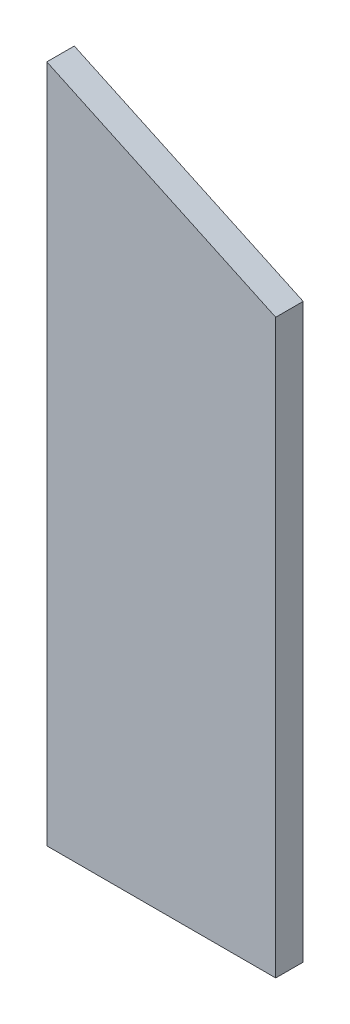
from build123d import *

# Parameters (mm, degrees)
BOSS_EXTRU_1_DEPTH = 12


with BuildPart() as part:
    # Esquisse1 → Boss.-Extru.1 (new body)
    with BuildSketch(Plane.XY):
        Polygon((0, 0), (0, 250), (-100, 296.630765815), (-100, 0), align=None)
    extrude(amount=BOSS_EXTRU_1_DEPTH)


solid = part.part
